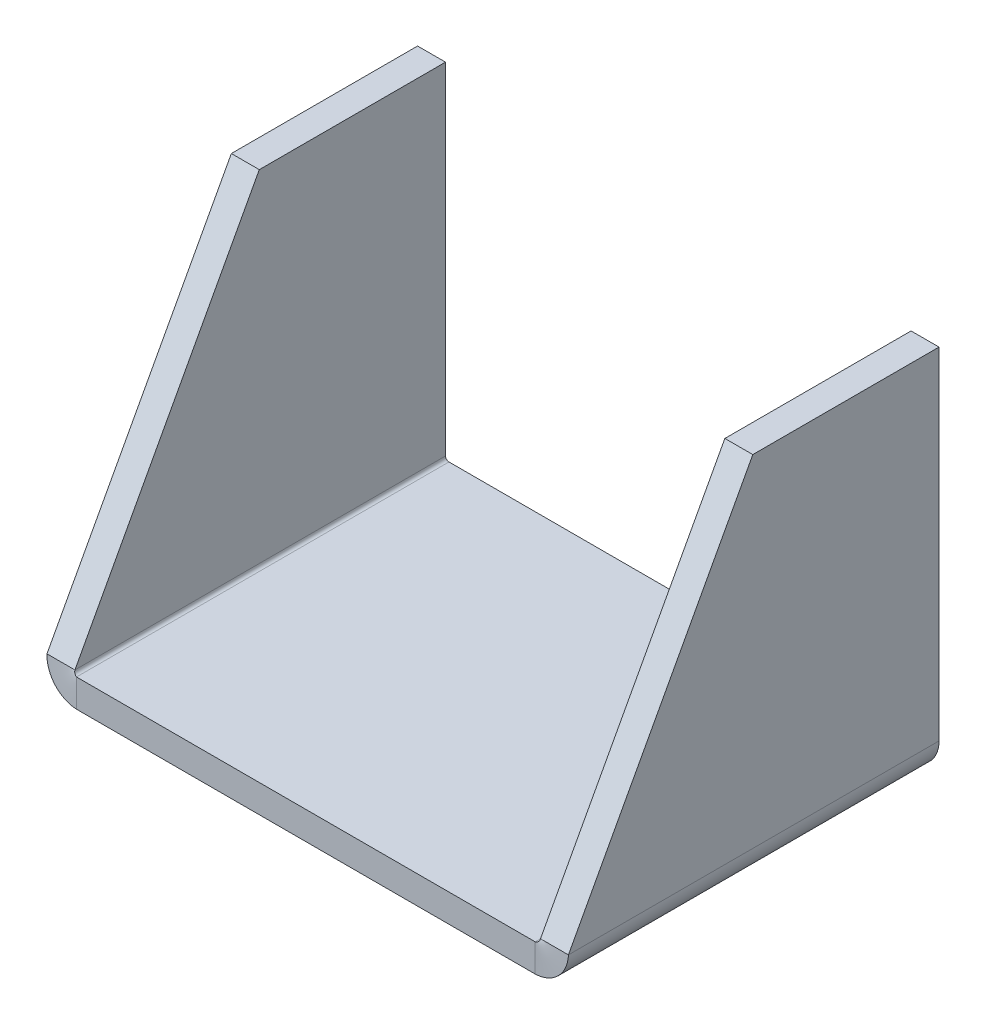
ISO-10303-21;
HEADER;
FILE_DESCRIPTION(('STEP AP214'),'2;1');
FILE_NAME('part.step','',(''),(''),'','','');
FILE_SCHEMA(('AUTOMOTIVE_DESIGN { 1 0 10303 214 1 1 1 1 }'));
ENDSEC;
DATA;
#1=APPLICATION_CONTEXT('core data for automotive mechanical design processes');
#2=APPLICATION_PROTOCOL_DEFINITION('international standard','automotive_design',2000,#1);
#3=PRODUCT_CONTEXT('',#1,'mechanical');
#4=PRODUCT('Part','Part','',(#3));
#5=PRODUCT_RELATED_PRODUCT_CATEGORY('part','',(#4));
#6=PRODUCT_DEFINITION_FORMATION('','',#4);
#7=PRODUCT_DEFINITION_CONTEXT('part definition',#1,'design');
#8=PRODUCT_DEFINITION('design','',#6,#7);
#9=PRODUCT_DEFINITION_SHAPE('','',#8);
#10=(LENGTH_UNIT() NAMED_UNIT(*) SI_UNIT(.MILLI.,.METRE.));
#11=(NAMED_UNIT(*) PLANE_ANGLE_UNIT() SI_UNIT($,.RADIAN.));
#12=(NAMED_UNIT(*) SI_UNIT($,.STERADIAN.) SOLID_ANGLE_UNIT());
#13=UNCERTAINTY_MEASURE_WITH_UNIT(LENGTH_MEASURE(1.E-05),#10,'distance_accuracy_value','');
#14=(GEOMETRIC_REPRESENTATION_CONTEXT(3) GLOBAL_UNCERTAINTY_ASSIGNED_CONTEXT((#13)) GLOBAL_UNIT_ASSIGNED_CONTEXT((#10,
#11,#12)) REPRESENTATION_CONTEXT('',''));
#15=CARTESIAN_POINT('',(0.,0.,0.));
#16=DIRECTION('',(0.,0.,1.));
#17=DIRECTION('',(1.,0.,0.));
#18=AXIS2_PLACEMENT_3D('',#15,#16,#17);
#19=CARTESIAN_POINT('',(-50.,-6.,80.));
#20=DIRECTION('',(0.,1.,0.));
#21=DIRECTION('',(0.,0.,1.));
#22=AXIS2_PLACEMENT_3D('',#19,#20,#21);
#23=PLANE('',#22);
#24=DIRECTION('',(0.,0.,-1.));
#25=VECTOR('',#24,1.);
#26=CARTESIAN_POINT('',(49.2634,-6.,0.));
#27=LINE('',#26,#25);
#28=CARTESIAN_POINT('',(49.2634,-6.,0.));
#29=VERTEX_POINT('',#28);
#30=CARTESIAN_POINT('',(49.2634,-6.,80.));
#31=VERTEX_POINT('',#30);
#32=EDGE_CURVE('E170',#29,#31,#27,.F.);
#33=ORIENTED_EDGE('',*,*,#32,.T.);
#34=DIRECTION('',(1.,0.,0.));
#35=VECTOR('',#34,1.);
#36=CARTESIAN_POINT('',(-50.,-6.,80.));
#37=LINE('',#36,#35);
#38=CARTESIAN_POINT('',(-49.2634,-6.,80.));
#39=VERTEX_POINT('',#38);
#40=EDGE_CURVE('E49',#39,#31,#37,.T.);
#41=ORIENTED_EDGE('',*,*,#40,.F.);
#42=DIRECTION('',(0.,0.,1.));
#43=VECTOR('',#42,1.);
#44=CARTESIAN_POINT('',(-49.2634,-6.,80.));
#45=LINE('',#44,#43);
#46=CARTESIAN_POINT('',(-49.2634,-6.,0.));
#47=VERTEX_POINT('',#46);
#48=EDGE_CURVE('E248',#39,#47,#45,.F.);
#49=ORIENTED_EDGE('',*,*,#48,.T.);
#50=DIRECTION('',(1.,0.,0.));
#51=VECTOR('',#50,1.);
#52=CARTESIAN_POINT('',(-50.,-6.,0.));
#53=LINE('',#52,#51);
#54=EDGE_CURVE('E263',#47,#29,#53,.T.);
#55=ORIENTED_EDGE('',*,*,#54,.T.);
#56=EDGE_LOOP('',(#33,#41,#49,#55));
#57=FACE_BOUND('',#56,.T.);
#58=ADVANCED_FACE('F41',(#57),#23,.F.);
#59=CARTESIAN_POINT('',(-50.,0.,80.));
#60=DIRECTION('',(0.,1.,0.));
#61=DIRECTION('',(0.,0.,1.));
#62=AXIS2_PLACEMENT_3D('',#59,#60,#61);
#63=PLANE('',#62);
#64=DIRECTION('',(1.,0.,0.));
#65=VECTOR('',#64,1.);
#66=CARTESIAN_POINT('',(-50.,0.,80.));
#67=LINE('',#66,#65);
#68=CARTESIAN_POINT('',(-49.2634,0.,80.));
#69=VERTEX_POINT('',#68);
#70=CARTESIAN_POINT('',(49.2634,0.,80.));
#71=VERTEX_POINT('',#70);
#72=EDGE_CURVE('E11',#69,#71,#67,.T.);
#73=ORIENTED_EDGE('',*,*,#72,.T.);
#74=DIRECTION('',(0.,0.,-1.));
#75=VECTOR('',#74,1.);
#76=CARTESIAN_POINT('',(49.2634,0.,0.));
#77=LINE('',#76,#75);
#78=CARTESIAN_POINT('',(49.2634,0.,0.));
#79=VERTEX_POINT('',#78);
#80=EDGE_CURVE('E174',#79,#71,#77,.F.);
#81=ORIENTED_EDGE('',*,*,#80,.F.);
#82=DIRECTION('',(1.,0.,0.));
#83=VECTOR('',#82,1.);
#84=CARTESIAN_POINT('',(-50.,0.,0.));
#85=LINE('',#84,#83);
#86=CARTESIAN_POINT('',(-49.2634,0.,0.));
#87=VERTEX_POINT('',#86);
#88=EDGE_CURVE('E44',#87,#79,#85,.T.);
#89=ORIENTED_EDGE('',*,*,#88,.F.);
#90=DIRECTION('',(0.,0.,1.));
#91=VECTOR('',#90,1.);
#92=CARTESIAN_POINT('',(-49.2634,0.,80.));
#93=LINE('',#92,#91);
#94=EDGE_CURVE('E56',#69,#87,#93,.F.);
#95=ORIENTED_EDGE('',*,*,#94,.F.);
#96=EDGE_LOOP('',(#73,#81,#89,#95));
#97=FACE_BOUND('',#96,.T.);
#98=ADVANCED_FACE('F365',(#97),#63,.T.);
#99=CARTESIAN_POINT('',(50.,-6.,80.));
#100=DIRECTION('',(0.,0.,-1.));
#101=DIRECTION('',(-1.,0.,0.));
#102=AXIS2_PLACEMENT_3D('',#99,#100,#101);
#103=PLANE('',#102);
#104=DIRECTION('',(0.,-1.,0.));
#105=VECTOR('',#104,1.);
#106=CARTESIAN_POINT('',(49.2634,0.,80.));
#107=LINE('',#106,#105);
#108=EDGE_CURVE('E276',#71,#31,#107,.T.);
#109=ORIENTED_EDGE('',*,*,#108,.F.);
#110=ORIENTED_EDGE('',*,*,#72,.F.);
#111=DIRECTION('',(0.,-1.,0.));
#112=VECTOR('',#111,1.);
#113=CARTESIAN_POINT('',(-49.2634,0.,80.));
#114=LINE('',#113,#112);
#115=EDGE_CURVE('E264',#69,#39,#114,.T.);
#116=ORIENTED_EDGE('',*,*,#115,.T.);
#117=ORIENTED_EDGE('',*,*,#40,.T.);
#118=EDGE_LOOP('',(#109,#110,#116,#117));
#119=FACE_BOUND('',#118,.T.);
#120=ADVANCED_FACE('F362',(#119),#103,.F.);
#121=CARTESIAN_POINT('',(50.,-6.,0.));
#122=DIRECTION('',(0.,0.,-1.));
#123=DIRECTION('',(-1.,0.,0.));
#124=AXIS2_PLACEMENT_3D('',#121,#122,#123);
#125=PLANE('',#124);
#126=ORIENTED_EDGE('',*,*,#88,.T.);
#127=DIRECTION('',(0.,-1.,0.));
#128=VECTOR('',#127,1.);
#129=CARTESIAN_POINT('',(49.2634,0.,0.));
#130=LINE('',#129,#128);
#131=EDGE_CURVE('E272',#79,#29,#130,.T.);
#132=ORIENTED_EDGE('',*,*,#131,.T.);
#133=ORIENTED_EDGE('',*,*,#54,.F.);
#134=DIRECTION('',(0.,-1.,0.));
#135=VECTOR('',#134,1.);
#136=CARTESIAN_POINT('',(-49.2634,0.,0.));
#137=LINE('',#136,#135);
#138=EDGE_CURVE('E64',#87,#47,#137,.T.);
#139=ORIENTED_EDGE('',*,*,#138,.F.);
#140=EDGE_LOOP('',(#126,#132,#133,#139));
#141=FACE_BOUND('',#140,.T.);
#142=ADVANCED_FACE('F271',(#141),#125,.T.);
#143=CARTESIAN_POINT('',(-49.2634,0.736600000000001,0.));
#144=DIRECTION('',(0.,0.,-1.));
#145=DIRECTION('',(0.,1.,0.));
#146=AXIS2_PLACEMENT_3D('',#143,#144,#145);
#147=PLANE('',#146);
#148=DIRECTION('',(-1.,0.,0.));
#149=VECTOR('',#148,1.);
#150=CARTESIAN_POINT('',(-50.,0.736599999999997,0.));
#151=LINE('',#150,#149);
#152=CARTESIAN_POINT('',(-50.,0.736599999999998,0.));
#153=VERTEX_POINT('',#152);
#154=CARTESIAN_POINT('',(-56.,0.736599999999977,0.));
#155=VERTEX_POINT('',#154);
#156=EDGE_CURVE('E304',#153,#155,#151,.T.);
#157=ORIENTED_EDGE('',*,*,#156,.F.);
#158=CARTESIAN_POINT('',(-49.2634,0.736600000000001,0.));
#159=DIRECTION('',(0.,0.,1.));
#160=DIRECTION('',(0.,-1.,0.));
#161=AXIS2_PLACEMENT_3D('',#158,#159,#160);
#162=CIRCLE('',#161,0.736599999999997);
#163=EDGE_CURVE('E249',#87,#153,#162,.F.);
#164=ORIENTED_EDGE('',*,*,#163,.F.);
#165=ORIENTED_EDGE('',*,*,#138,.T.);
#166=CARTESIAN_POINT('',(-49.2634,0.736600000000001,0.));
#167=DIRECTION('',(0.,0.,1.));
#168=DIRECTION('',(0.,-1.,0.));
#169=AXIS2_PLACEMENT_3D('',#166,#167,#168);
#170=CIRCLE('',#169,6.7366);
#171=EDGE_CURVE('E260',#47,#155,#170,.F.);
#172=ORIENTED_EDGE('',*,*,#171,.T.);
#173=EDGE_LOOP('',(#157,#164,#165,#172));
#174=FACE_BOUND('',#173,.T.);
#175=ADVANCED_FACE('F239',(#174),#147,.T.);
#176=CARTESIAN_POINT('',(-56.06,0.736599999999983,79.6018378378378));
#177=CARTESIAN_POINT('',(-56.06,-0.153233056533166,79.6350239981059));
#178=CARTESIAN_POINT('',(-55.8831026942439,-1.0423956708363,79.6681981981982));
#179=CARTESIAN_POINT('',(-55.2021765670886,-2.68629676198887,79.7345585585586));
#180=CARTESIAN_POINT('',(-54.6984156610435,-3.44022823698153,79.7677387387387));
#181=CARTESIAN_POINT('',(-53.4402282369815,-4.69841566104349,79.8340990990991));
#182=CARTESIAN_POINT('',(-52.6862967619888,-5.20217656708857,79.8672792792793));
#183=CARTESIAN_POINT('',(-51.0423956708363,-5.88310269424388,79.9336396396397));
#184=CARTESIAN_POINT('',(-50.1532330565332,-6.06,79.9668138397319));
#185=CARTESIAN_POINT('',(-49.2634,-6.06,80.));
#186=CARTESIAN_POINT('',(-56.,0.736599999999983,79.6018378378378));
#187=CARTESIAN_POINT('',(-56.,-0.14537764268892,79.6350239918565));
#188=CARTESIAN_POINT('',(-55.8246643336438,-1.02669079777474,79.6681981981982));
#189=CARTESIAN_POINT('',(-55.1497493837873,-2.65607962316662,79.7345585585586));
#190=CARTESIAN_POINT('',(-54.6504356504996,-3.40335543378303,79.7677387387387));
#191=CARTESIAN_POINT('',(-53.403355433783,-4.6504356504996,79.8340990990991));
#192=CARTESIAN_POINT('',(-52.6560796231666,-5.14974938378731,79.8672792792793));
#193=CARTESIAN_POINT('',(-51.0266907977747,-5.82466433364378,79.9336396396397));
#194=CARTESIAN_POINT('',(-50.145377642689,-6.,79.9668138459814));
#195=CARTESIAN_POINT('',(-49.2634,-6.,80.));
#196=CARTESIAN_POINT('',(-50.,0.736599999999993,79.6018378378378));
#197=CARTESIAN_POINT('',(-50.,0.640163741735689,79.6350233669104));
#198=CARTESIAN_POINT('',(-49.9808282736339,0.543796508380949,79.6681981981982));
#199=CARTESIAN_POINT('',(-49.9070310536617,0.365634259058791,79.7345585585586));
#200=CARTESIAN_POINT('',(-49.8524345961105,0.283924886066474,79.7677387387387));
#201=CARTESIAN_POINT('',(-49.7160751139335,0.147565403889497,79.8340990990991));
#202=CARTESIAN_POINT('',(-49.6343657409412,0.0929689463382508,79.8672792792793));
#203=CARTESIAN_POINT('',(-49.456203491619,0.0191717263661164,79.9336396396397));
#204=CARTESIAN_POINT('',(-49.3598362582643,0.,79.9668144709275));
#205=CARTESIAN_POINT('',(-49.2634,0.,80.));
#206=CARTESIAN_POINT('',(-49.9394,0.736599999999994,79.6018378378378));
#207=CARTESIAN_POINT('',(-49.9394,0.648097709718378,79.6350233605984));
#208=CARTESIAN_POINT('',(-49.9218055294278,0.559658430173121,79.6681981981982));
#209=CARTESIAN_POINT('',(-49.8540795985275,0.396153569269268,79.7345585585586));
#210=CARTESIAN_POINT('',(-49.8039747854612,0.321166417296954,79.7677387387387));
#211=CARTESIAN_POINT('',(-49.678833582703,0.196025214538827,79.8340990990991));
#212=CARTESIAN_POINT('',(-49.6038464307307,0.145920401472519,79.8672792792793));
#213=CARTESIAN_POINT('',(-49.4403415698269,0.0781944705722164,79.9336396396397));
#214=CARTESIAN_POINT('',(-49.3519022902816,0.0605999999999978,79.9668144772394));
#215=CARTESIAN_POINT('',(-49.2634,0.0605999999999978,80.));
#216=B_SPLINE_SURFACE_WITH_KNOTS('',1,3,((#176,#177,#178,#179,#180,#181,#182,#183,#184,#185),
(#186,#187,#188,#189,#190,#191,#192,#193,#194,#195),(#196,#197,#198,#199,#200,#201,#202,#203,
#204,#205),(#206,#207,#208,#209,#210,#211,#212,#213,#214,#215)),.UNSPECIFIED.,.F.,.F.,.F.,(2,1,
1,2),(4,2,2,2,4),(-0.01,0.,1.,1.0101),(0.,0.25,0.5,0.75,1.),.UNSPECIFIED.);
#217=CARTESIAN_POINT('',(-50.,0.736599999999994,79.6018378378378));
#218=CARTESIAN_POINT('',(-50.0000002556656,0.72454739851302,79.6059853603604));
#219=CARTESIAN_POINT('',(-49.9997041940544,0.712494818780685,79.6101328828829));
#220=CARTESIAN_POINT('',(-49.9985212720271,0.688418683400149,79.6184279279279));
#221=CARTESIAN_POINT('',(-49.997634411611,0.676395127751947,79.6225754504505));
#222=CARTESIAN_POINT('',(-49.9952717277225,0.652406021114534,79.6308704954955));
#223=CARTESIAN_POINT('',(-49.9937959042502,0.640440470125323,79.635018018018));
#224=CARTESIAN_POINT('',(-49.9902589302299,0.616596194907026,79.6433130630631));
#225=CARTESIAN_POINT('',(-49.988197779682,0.604717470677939,79.6474605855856));
#226=CARTESIAN_POINT('',(-49.983495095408,0.58107546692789,79.6557556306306));
#227=CARTESIAN_POINT('',(-49.980853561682,0.569312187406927,79.6599031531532));
#228=CARTESIAN_POINT('',(-49.9749964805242,0.545929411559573,79.6681981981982));
#229=CARTESIAN_POINT('',(-49.9717809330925,0.534309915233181,79.6723457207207));
#230=CARTESIAN_POINT('',(-49.9647835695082,0.511242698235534,79.6806407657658));
#231=CARTESIAN_POINT('',(-49.9610017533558,0.499794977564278,79.6847882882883));
#232=CARTESIAN_POINT('',(-49.9528809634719,0.477098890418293,79.6930833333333));
#233=CARTESIAN_POINT('',(-49.9485419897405,0.465850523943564,79.6972308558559));
#234=CARTESIAN_POINT('',(-49.9393173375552,0.443580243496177,79.7055259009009));
#235=CARTESIAN_POINT('',(-49.9344316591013,0.432558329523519,79.7096734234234));
#236=CARTESIAN_POINT('',(-49.9241253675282,0.410767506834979,79.7179684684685));
#237=CARTESIAN_POINT('',(-49.918704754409,0.399998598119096,79.722115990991));
#238=CARTESIAN_POINT('',(-49.907341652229,0.378739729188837,79.730411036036));
#239=CARTESIAN_POINT('',(-49.9013991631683,0.36824976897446,79.7345585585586));
#240=CARTESIAN_POINT('',(-49.8890066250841,0.347574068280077,79.7428536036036));
#241=CARTESIAN_POINT('',(-49.8825565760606,0.337388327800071,79.7470011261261));
#242=CARTESIAN_POINT('',(-49.8691644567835,0.317345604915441,79.7552961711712));
#243=CARTESIAN_POINT('',(-49.8622223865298,0.307488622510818,79.7594436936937));
#244=CARTESIAN_POINT('',(-49.8478629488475,0.288127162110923,79.7677387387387));
#245=CARTESIAN_POINT('',(-49.840445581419,0.278622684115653,79.7718862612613));
#246=CARTESIAN_POINT('',(-49.825153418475,0.259989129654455,79.7801813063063));
#247=CARTESIAN_POINT('',(-49.8172786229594,0.250860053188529,79.7843288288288));
#248=CARTESIAN_POINT('',(-49.8010905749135,0.232999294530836,79.7926238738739));
#249=CARTESIAN_POINT('',(-49.7927773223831,0.22426761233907,79.7967713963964));
#250=CARTESIAN_POINT('',(-49.7757323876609,0.207222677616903,79.8050664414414));
#251=CARTESIAN_POINT('',(-49.7670007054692,0.198909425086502,79.809213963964));
#252=CARTESIAN_POINT('',(-49.7491399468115,0.182721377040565,79.817509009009));
#253=CARTESIAN_POINT('',(-49.7400108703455,0.174846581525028,79.8216565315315));
#254=CARTESIAN_POINT('',(-49.7213773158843,0.15955441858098,79.8299515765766));
#255=CARTESIAN_POINT('',(-49.7118728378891,0.152137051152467,79.8340990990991));
#256=CARTESIAN_POINT('',(-49.6925113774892,0.137777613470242,79.8423941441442));
#257=CARTESIAN_POINT('',(-49.6826543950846,0.130835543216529,79.8465416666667));
#258=CARTESIAN_POINT('',(-49.6626116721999,0.117443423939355,79.8548367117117));
#259=CARTESIAN_POINT('',(-49.6524259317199,0.110993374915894,79.8589842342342));
#260=CARTESIAN_POINT('',(-49.6317502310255,0.0986008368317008,79.8672792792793));
#261=CARTESIAN_POINT('',(-49.6212602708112,0.092658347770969,79.8714268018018));
#262=CARTESIAN_POINT('',(-49.6000014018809,0.0812952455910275,79.8797218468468));
#263=CARTESIAN_POINT('',(-49.589232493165,0.0758746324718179,79.8838693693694));
#264=CARTESIAN_POINT('',(-49.5674416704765,0.0655683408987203,79.8921644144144));
#265=CARTESIAN_POINT('',(-49.5564197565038,0.0606826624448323,79.8963119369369));
#266=CARTESIAN_POINT('',(-49.5341494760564,0.0514580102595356,79.904606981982));
#267=CARTESIAN_POINT('',(-49.5229011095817,0.047119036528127,79.9087545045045));
#268=CARTESIAN_POINT('',(-49.5002050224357,0.0389982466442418,79.9170495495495));
#269=CARTESIAN_POINT('',(-49.4887573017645,0.0352164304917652,79.9211970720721));
#270=CARTESIAN_POINT('',(-49.4656900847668,0.0282190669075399,79.9294921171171));
#271=CARTESIAN_POINT('',(-49.4540705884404,0.0250035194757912,79.9336396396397));
#272=CARTESIAN_POINT('',(-49.4306878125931,0.0191464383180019,79.9419346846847));
#273=CARTESIAN_POINT('',(-49.4189245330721,0.0165049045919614,79.9460822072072));
#274=CARTESIAN_POINT('',(-49.3952825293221,0.0118022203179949,79.9543772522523));
#275=CARTESIAN_POINT('',(-49.383403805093,0.00974106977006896,79.9585247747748));
#276=CARTESIAN_POINT('',(-49.3595595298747,0.00620409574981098,79.9668198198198));
#277=CARTESIAN_POINT('',(-49.3475939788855,0.00472827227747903,79.9709673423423));
#278=CARTESIAN_POINT('',(-49.3236048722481,0.00236558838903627,79.9792623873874));
#279=CARTESIAN_POINT('',(-49.3115813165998,0.0014787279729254,79.9834099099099));
#280=CARTESIAN_POINT('',(-49.2875051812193,0.000295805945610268,79.991704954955));
#281=CARTESIAN_POINT('',(-49.275452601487,-2.55665594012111E-07,79.9958524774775));
#282=CARTESIAN_POINT('',(-49.2634,0.,80.));
#283=B_SPLINE_CURVE_WITH_KNOTS('',3,(#217,#218,#219,#220,#221,#222,#223,#224,#225,#226,#227,
#228,#229,#230,#231,#232,#233,#234,#235,#236,#237,#238,#239,#240,#241,#242,#243,#244,#245,#246,
#247,#248,#249,#250,#251,#252,#253,#254,#255,#256,#257,#258,#259,#260,#261,#262,#263,#264,#265,
#266,#267,#268,#269,#270,#271,#272,#273,#274,#275,#276,#277,#278,#279,#280,#281,#282),
.UNSPECIFIED.,.F.,.F.,(4,2,2,2,2,2,2,2,2,2,2,2,2,2,2,2,2,2,2,2,2,2,2,2,2,2,2,2,2,2,2,2,4),(0.,
0.0382353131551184,0.0764706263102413,0.114705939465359,0.152941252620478,0.191176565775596,
0.229411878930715,0.267647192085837,0.305882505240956,0.344117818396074,0.382353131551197,
0.420588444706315,0.458823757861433,0.497059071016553,0.535294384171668,0.573529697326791,
0.611765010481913,0.650000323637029,0.688235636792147,0.726470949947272,0.764706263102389,
0.802941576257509,0.841176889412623,0.879412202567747,0.91764751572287,0.955882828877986,
0.994118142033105,1.03235345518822,1.07058876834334,1.10882408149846,1.14705939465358,
1.1852947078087,1.22353002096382),.UNSPECIFIED.);
#284=CARTESIAN_POINT('',(-50.,0.736599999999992,79.6018378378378));
#285=VERTEX_POINT('',#284);
#286=EDGE_CURVE('E250',#285,#69,#283,.T.);
#287=DIRECTION('',(-1.,0.,0.));
#288=VECTOR('',#287,1.);
#289=CARTESIAN_POINT('',(-50.,0.736599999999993,79.6018378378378));
#290=LINE('',#289,#288);
#291=CARTESIAN_POINT('',(-56.,0.736599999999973,79.6018378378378));
#292=VERTEX_POINT('',#291);
#293=EDGE_CURVE('E307',#285,#292,#290,.T.);
#294=CARTESIAN_POINT('',(-56.,0.736599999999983,79.6018378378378));
#295=CARTESIAN_POINT('',(-56.0000023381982,0.626372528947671,79.6059853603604));
#296=CARTESIAN_POINT('',(-55.9972946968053,0.516145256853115,79.6101328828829));
#297=CARTESIAN_POINT('',(-55.9864762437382,0.295956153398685,79.6184279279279));
#298=CARTESIAN_POINT('',(-55.9783654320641,0.185994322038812,79.6225754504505));
#299=CARTESIAN_POINT('',(-55.9567574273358,-0.0333988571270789,79.6308704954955));
#300=CARTESIAN_POINT('',(-55.9432602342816,-0.142830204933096,79.635018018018));
#301=CARTESIAN_POINT('',(-55.9109127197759,-0.360898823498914,79.6433130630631));
#302=CARTESIAN_POINT('',(-55.8920623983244,-0.469536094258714,79.6474605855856));
#303=CARTESIAN_POINT('',(-55.8490538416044,-0.685754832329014,79.6557556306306));
#304=CARTESIAN_POINT('',(-55.8248956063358,-0.793336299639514,79.6599031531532));
#305=CARTESIAN_POINT('',(-55.771329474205,-1.00718426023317,79.6681981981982));
#306=CARTESIAN_POINT('',(-55.7419215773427,-1.11345075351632,79.6723457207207));
#307=CARTESIAN_POINT('',(-55.6779269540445,-1.32441276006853,79.6806407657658));
#308=CARTESIAN_POINT('',(-55.6433402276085,-1.42910827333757,79.6847882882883));
#309=CARTESIAN_POINT('',(-55.5690712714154,-1.63667609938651,79.6930833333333));
#310=CARTESIAN_POINT('',(-55.5293890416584,-1.7395484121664,79.6972308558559));
#311=CARTESIAN_POINT('',(-55.4450246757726,-1.94322200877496,79.7055259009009));
#312=CARTESIAN_POINT('',(-55.4003425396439,-2.04402329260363,79.7096734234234));
#313=CARTESIAN_POINT('',(-55.3060860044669,-2.24331199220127,79.7179684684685));
#314=CARTESIAN_POINT('',(-55.2565116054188,-2.34179940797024,79.722115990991));
#315=CARTESIAN_POINT('',(-55.1525899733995,-2.53622310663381,79.730411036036));
#316=CARTESIAN_POINT('',(-55.0982427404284,-2.63215938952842,79.7345585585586));
#317=CARTESIAN_POINT('',(-54.9849063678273,-2.82124970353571,79.7428536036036));
#318=CARTESIAN_POINT('',(-54.9259172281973,-2.9144037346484,79.7470011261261));
#319=CARTESIAN_POINT('',(-54.8034391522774,-3.09770512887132,79.7552961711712));
#320=CARTESIAN_POINT('',(-54.7399502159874,-3.18785249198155,79.7594436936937));
#321=CARTESIAN_POINT('',(-54.6086254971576,-3.36492337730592,79.7677387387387));
#322=CARTESIAN_POINT('',(-54.5407897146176,-3.45184689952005,79.7718862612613));
#323=CARTESIAN_POINT('',(-54.4009347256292,-3.62226069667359,79.7801813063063));
#324=CARTESIAN_POINT('',(-54.3289155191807,-3.705750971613,79.7843288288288));
#325=CARTESIAN_POINT('',(-54.1808671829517,-3.86909713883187,79.7926238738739));
#326=CARTESIAN_POINT('',(-54.1048380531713,-3.94895303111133,79.7967713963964));
#327=CARTESIAN_POINT('',(-53.9489530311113,-4.10483805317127,79.8050664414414));
#328=CARTESIAN_POINT('',(-53.8690971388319,-4.18086718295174,79.809213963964));
#329=CARTESIAN_POINT('',(-53.705750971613,-4.32891551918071,79.817509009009));
#330=CARTESIAN_POINT('',(-53.6222606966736,-4.4009347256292,79.8216565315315));
#331=CARTESIAN_POINT('',(-53.45184689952,-4.54078971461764,79.8299515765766));
#332=CARTESIAN_POINT('',(-53.3649233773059,-4.60862549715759,79.8340990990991));
#333=CARTESIAN_POINT('',(-53.1878524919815,-4.73995021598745,79.8423941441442));
#334=CARTESIAN_POINT('',(-53.0977051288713,-4.80343915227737,79.8465416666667));
#335=CARTESIAN_POINT('',(-52.9144037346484,-4.92591722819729,79.8548367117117));
#336=CARTESIAN_POINT('',(-52.8212497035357,-4.98490636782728,79.8589842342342));
#337=CARTESIAN_POINT('',(-52.6321593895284,-5.09824274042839,79.8672792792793));
#338=CARTESIAN_POINT('',(-52.5362231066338,-5.1525899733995,79.8714268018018));
#339=CARTESIAN_POINT('',(-52.3417994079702,-5.25651160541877,79.8797218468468));
#340=CARTESIAN_POINT('',(-52.2433119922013,-5.30608600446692,79.8838693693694));
#341=CARTESIAN_POINT('',(-52.0440232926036,-5.40034253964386,79.8921644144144));
#342=CARTESIAN_POINT('',(-51.9432220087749,-5.44502467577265,79.8963119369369));
#343=CARTESIAN_POINT('',(-51.7395484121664,-5.52938904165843,79.904606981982));
#344=CARTESIAN_POINT('',(-51.6366760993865,-5.56907127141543,79.9087545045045));
#345=CARTESIAN_POINT('',(-51.4291082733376,-5.64334022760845,79.9170495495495));
#346=CARTESIAN_POINT('',(-51.3244127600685,-5.67792695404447,79.9211970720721));
#347=CARTESIAN_POINT('',(-51.1134507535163,-5.74192157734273,79.9294921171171));
#348=CARTESIAN_POINT('',(-51.0071842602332,-5.77132947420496,79.9336396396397));
#349=CARTESIAN_POINT('',(-50.7933362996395,-5.82489560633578,79.9419346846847));
#350=CARTESIAN_POINT('',(-50.685754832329,-5.84905384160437,79.9460822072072));
#351=CARTESIAN_POINT('',(-50.4695360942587,-5.89206239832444,79.9543772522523));
#352=CARTESIAN_POINT('',(-50.3608988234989,-5.91091271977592,79.9585247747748));
#353=CARTESIAN_POINT('',(-50.1428302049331,-5.94326023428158,79.9668198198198));
#354=CARTESIAN_POINT('',(-50.0333988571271,-5.95675742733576,79.9709673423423));
#355=CARTESIAN_POINT('',(-49.8140056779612,-5.97836543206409,79.9792623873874));
#356=CARTESIAN_POINT('',(-49.7040438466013,-5.98647624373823,79.9834099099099));
#357=CARTESIAN_POINT('',(-49.4838547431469,-5.99729469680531,79.991704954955));
#358=CARTESIAN_POINT('',(-49.3736274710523,-6.00000233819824,79.9958524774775));
#359=CARTESIAN_POINT('',(-49.2634,-6.,80.));
#360=B_SPLINE_CURVE_WITH_KNOTS('',3,(#294,#295,#296,#297,#298,#299,#300,#301,#302,#303,#304,
#305,#306,#307,#308,#309,#310,#311,#312,#313,#314,#315,#316,#317,#318,#319,#320,#321,#322,#323,
#324,#325,#326,#327,#328,#329,#330,#331,#332,#333,#334,#335,#336,#337,#338,#339,#340,#341,#342,
#343,#344,#345,#346,#347,#348,#349,#350,#351,#352,#353,#354,#355,#356,#357,#358,#359),
.UNSPECIFIED.,.F.,.F.,(4,2,2,2,2,2,2,2,2,2,2,2,2,2,2,2,2,2,2,2,2,2,2,2,2,2,2,2,2,2,2,2,4),(0.,
0.33088290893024,0.661765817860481,0.992648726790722,1.32353163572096,1.6544145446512,
1.98529745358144,2.31618036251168,2.64706327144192,2.97794618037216,3.3088290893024,
3.63971199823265,3.97059490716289,4.30147781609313,4.63236072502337,4.96324363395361,
5.29412654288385,5.62500945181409,5.95589236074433,6.28677526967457,6.61765817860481,
6.94854108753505,7.27942399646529,7.61030690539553,7.94118981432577,8.27207272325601,
8.60295563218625,8.9338385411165,9.26472145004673,9.59560435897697,9.92648726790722,
10.2573701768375,10.5882530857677),.UNSPECIFIED.);
#361=EDGE_CURVE('E243',#292,#39,#360,.T.);
#362=ORIENTED_EDGE('',*,*,#286,.F.);
#363=ORIENTED_EDGE('',*,*,#293,.T.);
#364=ORIENTED_EDGE('',*,*,#361,.T.);
#365=ORIENTED_EDGE('',*,*,#115,.F.);
#366=EDGE_LOOP('',(#362,#363,#364,#365));
#367=FACE_BOUND('',#366,.T.);
#368=ADVANCED_FACE('F237',(#367),#216,.F.);
#369=CARTESIAN_POINT('',(-49.2634,0.736599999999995,80.));
#370=DIRECTION('',(0.,0.,1.));
#371=DIRECTION('',(-1.,0.,0.));
#372=AXIS2_PLACEMENT_3D('',#369,#370,#371);
#373=CYLINDRICAL_SURFACE('',#372,6.7366);
#374=ORIENTED_EDGE('',*,*,#48,.F.);
#375=ORIENTED_EDGE('',*,*,#361,.F.);
#376=DIRECTION('',(0.,0.,-1.));
#377=VECTOR('',#376,1.);
#378=CARTESIAN_POINT('',(-56.,0.736599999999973,80.));
#379=LINE('',#378,#377);
#380=EDGE_CURVE('E310',#292,#155,#379,.T.);
#381=ORIENTED_EDGE('',*,*,#380,.T.);
#382=ORIENTED_EDGE('',*,*,#171,.F.);
#383=EDGE_LOOP('',(#374,#375,#381,#382));
#384=FACE_BOUND('',#383,.T.);
#385=ADVANCED_FACE('F233',(#384),#373,.T.);
#386=CARTESIAN_POINT('',(-49.2634,0.736599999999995,80.));
#387=DIRECTION('',(0.,0.,1.));
#388=DIRECTION('',(-1.,0.,0.));
#389=AXIS2_PLACEMENT_3D('',#386,#387,#388);
#390=CYLINDRICAL_SURFACE('',#389,0.736599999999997);
#391=ORIENTED_EDGE('',*,*,#94,.T.);
#392=ORIENTED_EDGE('',*,*,#163,.T.);
#393=DIRECTION('',(0.,0.,1.));
#394=VECTOR('',#393,1.);
#395=CARTESIAN_POINT('',(-50.,0.736599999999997,0.));
#396=LINE('',#395,#394);
#397=EDGE_CURVE('E305',#153,#285,#396,.T.);
#398=ORIENTED_EDGE('',*,*,#397,.T.);
#399=ORIENTED_EDGE('',*,*,#286,.T.);
#400=EDGE_LOOP('',(#391,#392,#398,#399));
#401=FACE_BOUND('',#400,.T.);
#402=ADVANCED_FACE('F231',(#401),#390,.F.);
#403=CARTESIAN_POINT('',(-56.0000000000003,74.,40.));
#404=DIRECTION('',(0.,-0.475517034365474,-0.879706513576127));
#405=DIRECTION('',(0.,0.879706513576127,-0.475517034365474));
#406=AXIS2_PLACEMENT_3D('',#403,#404,#405);
#407=PLANE('',#406);
#408=ORIENTED_EDGE('',*,*,#293,.F.);
#409=DIRECTION('',(0.,0.879706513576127,-0.475517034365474));
#410=VECTOR('',#409,1.);
#411=CARTESIAN_POINT('',(-50.0000000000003,74.,40.));
#412=LINE('',#411,#410);
#413=CARTESIAN_POINT('',(-50.0000000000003,74.,40.));
#414=VERTEX_POINT('',#413);
#415=EDGE_CURVE('E314',#285,#414,#412,.T.);
#416=ORIENTED_EDGE('',*,*,#415,.T.);
#417=DIRECTION('',(1.,0.,0.));
#418=VECTOR('',#417,1.);
#419=CARTESIAN_POINT('',(-56.0000000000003,74.,40.));
#420=LINE('',#419,#418);
#421=CARTESIAN_POINT('',(-56.0000000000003,74.,40.));
#422=VERTEX_POINT('',#421);
#423=EDGE_CURVE('E331',#422,#414,#420,.T.);
#424=ORIENTED_EDGE('',*,*,#423,.F.);
#425=DIRECTION('',(0.,0.879706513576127,-0.475517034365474));
#426=VECTOR('',#425,1.);
#427=CARTESIAN_POINT('',(-56.0000000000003,74.,40.));
#428=LINE('',#427,#426);
#429=EDGE_CURVE('E315',#292,#422,#428,.T.);
#430=ORIENTED_EDGE('',*,*,#429,.F.);
#431=EDGE_LOOP('',(#408,#416,#424,#430));
#432=FACE_BOUND('',#431,.T.);
#433=ADVANCED_FACE('F224',(#432),#407,.F.);
#434=CARTESIAN_POINT('',(-56.,0.,0.));
#435=DIRECTION('',(0.,0.,1.));
#436=DIRECTION('',(1.,0.,0.));
#437=AXIS2_PLACEMENT_3D('',#434,#435,#436);
#438=PLANE('',#437);
#439=ORIENTED_EDGE('',*,*,#156,.T.);
#440=DIRECTION('',(0.,-1.,0.));
#441=VECTOR('',#440,1.);
#442=CARTESIAN_POINT('',(-56.,0.,0.));
#443=LINE('',#442,#441);
#444=CARTESIAN_POINT('',(-56.0000000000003,74.,0.));
#445=VERTEX_POINT('',#444);
#446=EDGE_CURVE('E320',#445,#155,#443,.T.);
#447=ORIENTED_EDGE('',*,*,#446,.F.);
#448=DIRECTION('',(1.,0.,0.));
#449=VECTOR('',#448,1.);
#450=CARTESIAN_POINT('',(-56.0000000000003,74.,0.));
#451=LINE('',#450,#449);
#452=CARTESIAN_POINT('',(-50.0000000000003,74.,0.));
#453=VERTEX_POINT('',#452);
#454=EDGE_CURVE('E323',#445,#453,#451,.T.);
#455=ORIENTED_EDGE('',*,*,#454,.T.);
#456=DIRECTION('',(0.,-1.,0.));
#457=VECTOR('',#456,1.);
#458=CARTESIAN_POINT('',(-50.,0.,0.));
#459=LINE('',#458,#457);
#460=EDGE_CURVE('E318',#453,#153,#459,.T.);
#461=ORIENTED_EDGE('',*,*,#460,.T.);
#462=EDGE_LOOP('',(#439,#447,#455,#461));
#463=FACE_BOUND('',#462,.T.);
#464=ADVANCED_FACE('F217',(#463),#438,.F.);
#465=CARTESIAN_POINT('',(-56.,0.,80.));
#466=DIRECTION('',(1.,0.,0.));
#467=DIRECTION('',(0.,1.,0.));
#468=AXIS2_PLACEMENT_3D('',#465,#466,#467);
#469=PLANE('',#468);
#470=ORIENTED_EDGE('',*,*,#380,.F.);
#471=ORIENTED_EDGE('',*,*,#429,.T.);
#472=DIRECTION('',(0.,0.,-1.));
#473=VECTOR('',#472,1.);
#474=CARTESIAN_POINT('',(-56.0000000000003,74.,0.));
#475=LINE('',#474,#473);
#476=EDGE_CURVE('E317',#422,#445,#475,.T.);
#477=ORIENTED_EDGE('',*,*,#476,.T.);
#478=ORIENTED_EDGE('',*,*,#446,.T.);
#479=EDGE_LOOP('',(#470,#471,#477,#478));
#480=FACE_BOUND('',#479,.T.);
#481=ADVANCED_FACE('F213',(#480),#469,.F.);
#482=CARTESIAN_POINT('',(-50.,0.,80.));
#483=DIRECTION('',(1.,0.,0.));
#484=DIRECTION('',(0.,1.,0.));
#485=AXIS2_PLACEMENT_3D('',#482,#483,#484);
#486=PLANE('',#485);
#487=ORIENTED_EDGE('',*,*,#415,.F.);
#488=ORIENTED_EDGE('',*,*,#397,.F.);
#489=ORIENTED_EDGE('',*,*,#460,.F.);
#490=DIRECTION('',(0.,0.,-1.));
#491=VECTOR('',#490,1.);
#492=CARTESIAN_POINT('',(-50.0000000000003,74.,0.));
#493=LINE('',#492,#491);
#494=EDGE_CURVE('E325',#414,#453,#493,.T.);
#495=ORIENTED_EDGE('',*,*,#494,.F.);
#496=EDGE_LOOP('',(#487,#488,#489,#495));
#497=FACE_BOUND('',#496,.T.);
#498=ADVANCED_FACE('F216',(#497),#486,.T.);
#499=CARTESIAN_POINT('',(-56.0000000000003,74.,0.));
#500=DIRECTION('',(0.,-1.,0.));
#501=DIRECTION('',(1.,0.,0.));
#502=AXIS2_PLACEMENT_3D('',#499,#500,#501);
#503=PLANE('',#502);
#504=ORIENTED_EDGE('',*,*,#494,.T.);
#505=ORIENTED_EDGE('',*,*,#454,.F.);
#506=ORIENTED_EDGE('',*,*,#476,.F.);
#507=ORIENTED_EDGE('',*,*,#423,.T.);
#508=EDGE_LOOP('',(#504,#505,#506,#507));
#509=FACE_BOUND('',#508,.T.);
#510=ADVANCED_FACE('F203',(#509),#503,.F.);
#511=CARTESIAN_POINT('',(49.2634,-6.06,80.));
#512=CARTESIAN_POINT('',(50.1532330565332,-6.06,79.9668138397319));
#513=CARTESIAN_POINT('',(51.0423956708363,-5.88310269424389,79.9336396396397));
#514=CARTESIAN_POINT('',(52.6862967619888,-5.20217656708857,79.8672792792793));
#515=CARTESIAN_POINT('',(53.4402282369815,-4.6984156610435,79.8340990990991));
#516=CARTESIAN_POINT('',(54.6984156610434,-3.44022823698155,79.7677387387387));
#517=CARTESIAN_POINT('',(55.2021765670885,-2.68629676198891,79.7345585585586));
#518=CARTESIAN_POINT('',(55.8831026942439,-1.04239567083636,79.6681981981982));
#519=CARTESIAN_POINT('',(56.06,-0.153233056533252,79.6350239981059));
#520=CARTESIAN_POINT('',(56.06,0.736599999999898,79.6018378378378));
#521=CARTESIAN_POINT('',(49.2634,-6.,80.));
#522=CARTESIAN_POINT('',(50.145377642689,-6.,79.9668138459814));
#523=CARTESIAN_POINT('',(51.0266907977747,-5.82466433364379,79.9336396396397));
#524=CARTESIAN_POINT('',(52.6560796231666,-5.14974938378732,79.8672792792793));
#525=CARTESIAN_POINT('',(53.403355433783,-4.65043565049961,79.8340990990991));
#526=CARTESIAN_POINT('',(54.6504356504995,-3.40335543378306,79.7677387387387));
#527=CARTESIAN_POINT('',(55.1497493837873,-2.65607962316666,79.7345585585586));
#528=CARTESIAN_POINT('',(55.8246643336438,-1.02669079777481,79.6681981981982));
#529=CARTESIAN_POINT('',(56.,-0.145377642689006,79.6350239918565));
#530=CARTESIAN_POINT('',(56.,0.736599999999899,79.6018378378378));
#531=CARTESIAN_POINT('',(49.2634,0.,80.));
#532=CARTESIAN_POINT('',(49.3598362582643,0.,79.9668144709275));
#533=CARTESIAN_POINT('',(49.456203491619,0.0191717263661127,79.9336396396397));
#534=CARTESIAN_POINT('',(49.6343657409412,0.092968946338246,79.8672792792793));
#535=CARTESIAN_POINT('',(49.7160751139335,0.147565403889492,79.8340990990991));
#536=CARTESIAN_POINT('',(49.8524345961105,0.283924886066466,79.7677387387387));
#537=CARTESIAN_POINT('',(49.9070310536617,0.365634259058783,79.7345585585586));
#538=CARTESIAN_POINT('',(49.9808282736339,0.543796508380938,79.6681981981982));
#539=CARTESIAN_POINT('',(50.,0.640163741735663,79.6350233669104));
#540=CARTESIAN_POINT('',(50.,0.736599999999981,79.6018378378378));
#541=CARTESIAN_POINT('',(49.2634,0.0605999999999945,80.));
#542=CARTESIAN_POINT('',(49.3519022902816,0.0605999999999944,79.9668144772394));
#543=CARTESIAN_POINT('',(49.4403415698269,0.0781944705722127,79.9336396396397));
#544=CARTESIAN_POINT('',(49.6038464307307,0.145920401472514,79.8672792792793));
#545=CARTESIAN_POINT('',(49.678833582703,0.196025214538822,79.8340990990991));
#546=CARTESIAN_POINT('',(49.8039747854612,0.321166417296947,79.7677387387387));
#547=CARTESIAN_POINT('',(49.8540795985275,0.39615356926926,79.7345585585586));
#548=CARTESIAN_POINT('',(49.9218055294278,0.559658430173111,79.6681981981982));
#549=CARTESIAN_POINT('',(49.9394,0.648097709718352,79.6350233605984));
#550=CARTESIAN_POINT('',(49.9394,0.736599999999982,79.6018378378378));
#551=B_SPLINE_SURFACE_WITH_KNOTS('',1,3,((#511,#512,#513,#514,#515,#516,#517,#518,#519,#520),
(#521,#522,#523,#524,#525,#526,#527,#528,#529,#530),(#531,#532,#533,#534,#535,#536,#537,#538,
#539,#540),(#541,#542,#543,#544,#545,#546,#547,#548,#549,#550)),.UNSPECIFIED.,.F.,.F.,.F.,(2,1,
1,2),(4,2,2,2,4),(-0.01,0.,1.,1.0101),(0.,0.25,0.5,0.75,1.),.UNSPECIFIED.);
#552=DIRECTION('',(1.,0.,0.));
#553=VECTOR('',#552,1.);
#554=CARTESIAN_POINT('',(50.,0.736599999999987,79.6018378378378));
#555=LINE('',#554,#553);
#556=CARTESIAN_POINT('',(50.,0.736599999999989,79.6018378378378));
#557=VERTEX_POINT('',#556);
#558=CARTESIAN_POINT('',(56.,0.736599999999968,79.6018378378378));
#559=VERTEX_POINT('',#558);
#560=EDGE_CURVE('E285',#557,#559,#555,.T.);
#561=CARTESIAN_POINT('',(49.2634,0.,80.));
#562=CARTESIAN_POINT('',(49.275452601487,-2.5566559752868E-07,79.9958524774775));
#563=CARTESIAN_POINT('',(49.2875051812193,0.000295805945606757,79.991704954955));
#564=CARTESIAN_POINT('',(49.3115813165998,0.00147872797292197,79.9834099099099));
#565=CARTESIAN_POINT('',(49.3236048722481,0.00236558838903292,79.9792623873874));
#566=CARTESIAN_POINT('',(49.3475939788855,0.00472827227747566,79.9709673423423));
#567=CARTESIAN_POINT('',(49.3595595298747,0.00620409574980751,79.9668198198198));
#568=CARTESIAN_POINT('',(49.383403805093,0.0097410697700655,79.9585247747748));
#569=CARTESIAN_POINT('',(49.3952825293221,0.0118022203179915,79.9543772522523));
#570=CARTESIAN_POINT('',(49.4189245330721,0.0165049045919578,79.9460822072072));
#571=CARTESIAN_POINT('',(49.4306878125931,0.019146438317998,79.9419346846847));
#572=CARTESIAN_POINT('',(49.4540705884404,0.0250035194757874,79.9336396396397));
#573=CARTESIAN_POINT('',(49.4656900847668,0.0282190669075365,79.9294921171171));
#574=CARTESIAN_POINT('',(49.4887573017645,0.0352164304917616,79.9211970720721));
#575=CARTESIAN_POINT('',(49.5002050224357,0.0389982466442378,79.9170495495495));
#576=CARTESIAN_POINT('',(49.5229011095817,0.0471190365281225,79.9087545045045));
#577=CARTESIAN_POINT('',(49.5341494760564,0.0514580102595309,79.904606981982));
#578=CARTESIAN_POINT('',(49.5564197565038,0.0606826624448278,79.8963119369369));
#579=CARTESIAN_POINT('',(49.5674416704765,0.0655683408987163,79.8921644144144));
#580=CARTESIAN_POINT('',(49.589232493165,0.0758746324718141,79.8838693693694));
#581=CARTESIAN_POINT('',(49.6000014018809,0.0812952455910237,79.8797218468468));
#582=CARTESIAN_POINT('',(49.6212602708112,0.0926583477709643,79.8714268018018));
#583=CARTESIAN_POINT('',(49.6317502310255,0.0986008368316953,79.8672792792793));
#584=CARTESIAN_POINT('',(49.6524259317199,0.110993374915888,79.8589842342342));
#585=CARTESIAN_POINT('',(49.6626116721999,0.11744342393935,79.8548367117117));
#586=CARTESIAN_POINT('',(49.6826543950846,0.130835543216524,79.8465416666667));
#587=CARTESIAN_POINT('',(49.6925113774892,0.137777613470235,79.8423941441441));
#588=CARTESIAN_POINT('',(49.7118728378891,0.15213705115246,79.8340990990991));
#589=CARTESIAN_POINT('',(49.7213773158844,0.159554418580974,79.8299515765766));
#590=CARTESIAN_POINT('',(49.7400108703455,0.174846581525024,79.8216565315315));
#591=CARTESIAN_POINT('',(49.7491399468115,0.18272137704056,79.817509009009));
#592=CARTESIAN_POINT('',(49.7670007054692,0.198909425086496,79.809213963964));
#593=CARTESIAN_POINT('',(49.7757323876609,0.207222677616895,79.8050664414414));
#594=CARTESIAN_POINT('',(49.7927773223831,0.224267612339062,79.7967713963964));
#595=CARTESIAN_POINT('',(49.8010905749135,0.23299929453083,79.7926238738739));
#596=CARTESIAN_POINT('',(49.8172786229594,0.250860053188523,79.7843288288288));
#597=CARTESIAN_POINT('',(49.825153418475,0.259989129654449,79.7801813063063));
#598=CARTESIAN_POINT('',(49.840445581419,0.278622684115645,79.7718862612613));
#599=CARTESIAN_POINT('',(49.8478629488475,0.288127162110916,79.7677387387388));
#600=CARTESIAN_POINT('',(49.8622223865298,0.30748862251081,79.7594436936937));
#601=CARTESIAN_POINT('',(49.8691644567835,0.317345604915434,79.7552961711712));
#602=CARTESIAN_POINT('',(49.8825565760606,0.337388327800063,79.7470011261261));
#603=CARTESIAN_POINT('',(49.8890066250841,0.347574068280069,79.7428536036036));
#604=CARTESIAN_POINT('',(49.9013991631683,0.368249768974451,79.7345585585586));
#605=CARTESIAN_POINT('',(49.907341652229,0.378739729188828,79.730411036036));
#606=CARTESIAN_POINT('',(49.918704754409,0.399998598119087,79.722115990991));
#607=CARTESIAN_POINT('',(49.9241253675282,0.41076750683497,79.7179684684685));
#608=CARTESIAN_POINT('',(49.9344316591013,0.43255832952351,79.7096734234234));
#609=CARTESIAN_POINT('',(49.9393173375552,0.443580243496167,79.7055259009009));
#610=CARTESIAN_POINT('',(49.9485419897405,0.465850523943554,79.6972308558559));
#611=CARTESIAN_POINT('',(49.9528809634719,0.477098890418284,79.6930833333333));
#612=CARTESIAN_POINT('',(49.9610017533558,0.499794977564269,79.6847882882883));
#613=CARTESIAN_POINT('',(49.9647835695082,0.511242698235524,79.6806407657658));
#614=CARTESIAN_POINT('',(49.9717809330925,0.53430991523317,79.6723457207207));
#615=CARTESIAN_POINT('',(49.9749964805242,0.545929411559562,79.6681981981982));
#616=CARTESIAN_POINT('',(49.980853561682,0.569312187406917,79.6599031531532));
#617=CARTESIAN_POINT('',(49.983495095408,0.58107546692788,79.6557556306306));
#618=CARTESIAN_POINT('',(49.988197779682,0.604717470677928,79.6474605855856));
#619=CARTESIAN_POINT('',(49.9902589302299,0.616596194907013,79.6433130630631));
#620=CARTESIAN_POINT('',(49.9937959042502,0.640440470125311,79.635018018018));
#621=CARTESIAN_POINT('',(49.9952717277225,0.652406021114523,79.6308704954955));
#622=CARTESIAN_POINT('',(49.997634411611,0.676395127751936,79.6225754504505));
#623=CARTESIAN_POINT('',(49.9985212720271,0.688418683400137,79.6184279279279));
#624=CARTESIAN_POINT('',(49.9997041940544,0.712494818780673,79.6101328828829));
#625=CARTESIAN_POINT('',(50.0000002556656,0.724547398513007,79.6059853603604));
#626=CARTESIAN_POINT('',(50.,0.736599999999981,79.6018378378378));
#627=B_SPLINE_CURVE_WITH_KNOTS('',3,(#561,#562,#563,#564,#565,#566,#567,#568,#569,#570,#571,
#572,#573,#574,#575,#576,#577,#578,#579,#580,#581,#582,#583,#584,#585,#586,#587,#588,#589,#590,
#591,#592,#593,#594,#595,#596,#597,#598,#599,#600,#601,#602,#603,#604,#605,#606,#607,#608,#609,
#610,#611,#612,#613,#614,#615,#616,#617,#618,#619,#620,#621,#622,#623,#624,#625,#626),
.UNSPECIFIED.,.F.,.F.,(4,2,2,2,2,2,2,2,2,2,2,2,2,2,2,2,2,2,2,2,2,2,2,2,2,2,2,2,2,2,2,2,4),(0.,
0.0382353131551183,0.0764706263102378,0.114705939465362,0.15294125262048,0.191176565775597,
0.229411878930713,0.267647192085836,0.305882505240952,0.344117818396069,0.382353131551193,
0.420588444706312,0.458823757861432,0.497059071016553,0.535294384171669,0.573529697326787,
0.611765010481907,0.650000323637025,0.688235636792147,0.726470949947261,0.764706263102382,
0.802941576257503,0.841176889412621,0.879412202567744,0.917647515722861,0.955882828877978,
0.994118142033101,1.03235345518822,1.07058876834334,1.10882408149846,1.14705939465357,
1.1852947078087,1.22353002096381),.UNSPECIFIED.);
#628=EDGE_CURVE('E171',#71,#557,#627,.T.);
#629=CARTESIAN_POINT('',(49.2634,-6.00000000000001,80.));
#630=CARTESIAN_POINT('',(49.3736274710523,-6.00000233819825,79.9958524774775));
#631=CARTESIAN_POINT('',(49.4838547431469,-5.99729469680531,79.991704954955));
#632=CARTESIAN_POINT('',(49.7040438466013,-5.98647624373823,79.9834099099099));
#633=CARTESIAN_POINT('',(49.8140056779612,-5.97836543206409,79.9792623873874));
#634=CARTESIAN_POINT('',(50.0333988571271,-5.95675742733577,79.9709673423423));
#635=CARTESIAN_POINT('',(50.1428302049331,-5.94326023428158,79.9668198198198));
#636=CARTESIAN_POINT('',(50.3608988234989,-5.91091271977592,79.9585247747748));
#637=CARTESIAN_POINT('',(50.4695360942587,-5.89206239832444,79.9543772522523));
#638=CARTESIAN_POINT('',(50.685754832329,-5.84905384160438,79.9460822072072));
#639=CARTESIAN_POINT('',(50.7933362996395,-5.82489560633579,79.9419346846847));
#640=CARTESIAN_POINT('',(51.0071842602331,-5.77132947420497,79.9336396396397));
#641=CARTESIAN_POINT('',(51.1134507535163,-5.74192157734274,79.9294921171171));
#642=CARTESIAN_POINT('',(51.3244127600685,-5.67792695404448,79.9211970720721));
#643=CARTESIAN_POINT('',(51.4291082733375,-5.64334022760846,79.9170495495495));
#644=CARTESIAN_POINT('',(51.6366760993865,-5.56907127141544,79.9087545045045));
#645=CARTESIAN_POINT('',(51.7395484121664,-5.52938904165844,79.904606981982));
#646=CARTESIAN_POINT('',(51.9432220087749,-5.44502467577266,79.8963119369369));
#647=CARTESIAN_POINT('',(52.0440232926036,-5.40034253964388,79.8921644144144));
#648=CARTESIAN_POINT('',(52.2433119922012,-5.30608600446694,79.8838693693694));
#649=CARTESIAN_POINT('',(52.3417994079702,-5.25651160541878,79.8797218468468));
#650=CARTESIAN_POINT('',(52.5362231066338,-5.15258997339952,79.8714268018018));
#651=CARTESIAN_POINT('',(52.6321593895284,-5.09824274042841,79.8672792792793));
#652=CARTESIAN_POINT('',(52.8212497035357,-4.98490636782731,79.8589842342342));
#653=CARTESIAN_POINT('',(52.9144037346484,-4.92591722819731,79.8548367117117));
#654=CARTESIAN_POINT('',(53.0977051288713,-4.8034391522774,79.8465416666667));
#655=CARTESIAN_POINT('',(53.1878524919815,-4.73995021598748,79.8423941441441));
#656=CARTESIAN_POINT('',(53.3649233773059,-4.60862549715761,79.8340990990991));
#657=CARTESIAN_POINT('',(53.45184689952,-4.54078971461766,79.8299515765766));
#658=CARTESIAN_POINT('',(53.6222606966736,-4.40093472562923,79.8216565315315));
#659=CARTESIAN_POINT('',(53.705750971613,-4.32891551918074,79.817509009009));
#660=CARTESIAN_POINT('',(53.8690971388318,-4.18086718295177,79.809213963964));
#661=CARTESIAN_POINT('',(53.9489530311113,-4.1048380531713,79.8050664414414));
#662=CARTESIAN_POINT('',(54.1048380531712,-3.94895303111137,79.7967713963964));
#663=CARTESIAN_POINT('',(54.1808671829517,-3.8690971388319,79.7926238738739));
#664=CARTESIAN_POINT('',(54.3289155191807,-3.70575097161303,79.7843288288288));
#665=CARTESIAN_POINT('',(54.4009347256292,-3.62226069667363,79.7801813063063));
#666=CARTESIAN_POINT('',(54.5407897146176,-3.45184689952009,79.7718862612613));
#667=CARTESIAN_POINT('',(54.6086254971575,-3.36492337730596,79.7677387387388));
#668=CARTESIAN_POINT('',(54.7399502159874,-3.18785249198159,79.7594436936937));
#669=CARTESIAN_POINT('',(54.8034391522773,-3.09770512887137,79.7552961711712));
#670=CARTESIAN_POINT('',(54.9259172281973,-2.91440373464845,79.7470011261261));
#671=CARTESIAN_POINT('',(54.9849063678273,-2.82124970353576,79.7428536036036));
#672=CARTESIAN_POINT('',(55.0982427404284,-2.63215938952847,79.7345585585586));
#673=CARTESIAN_POINT('',(55.1525899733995,-2.53622310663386,79.730411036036));
#674=CARTESIAN_POINT('',(55.2565116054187,-2.34179940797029,79.722115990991));
#675=CARTESIAN_POINT('',(55.3060860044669,-2.24331199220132,79.7179684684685));
#676=CARTESIAN_POINT('',(55.4003425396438,-2.04402329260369,79.7096734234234));
#677=CARTESIAN_POINT('',(55.4450246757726,-1.94322200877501,79.7055259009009));
#678=CARTESIAN_POINT('',(55.5293890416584,-1.73954841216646,79.6972308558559));
#679=CARTESIAN_POINT('',(55.5690712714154,-1.63667609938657,79.6930833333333));
#680=CARTESIAN_POINT('',(55.6433402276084,-1.42910827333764,79.6847882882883));
#681=CARTESIAN_POINT('',(55.6779269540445,-1.32441276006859,79.6806407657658));
#682=CARTESIAN_POINT('',(55.7419215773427,-1.11345075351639,79.6723457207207));
#683=CARTESIAN_POINT('',(55.7713294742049,-1.00718426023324,79.6681981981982));
#684=CARTESIAN_POINT('',(55.8248956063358,-0.793336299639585,79.6599031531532));
#685=CARTESIAN_POINT('',(55.8490538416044,-0.685754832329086,79.6557556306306));
#686=CARTESIAN_POINT('',(55.8920623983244,-0.469536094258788,79.6474605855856));
#687=CARTESIAN_POINT('',(55.9109127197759,-0.360898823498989,79.6433130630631));
#688=CARTESIAN_POINT('',(55.9432602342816,-0.142830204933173,79.635018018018));
#689=CARTESIAN_POINT('',(55.9567574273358,-0.0333988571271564,79.6308704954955));
#690=CARTESIAN_POINT('',(55.9783654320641,0.185994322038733,79.6225754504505));
#691=CARTESIAN_POINT('',(55.9864762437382,0.295956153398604,79.6184279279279));
#692=CARTESIAN_POINT('',(55.9972946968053,0.516145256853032,79.6101328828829));
#693=CARTESIAN_POINT('',(56.0000023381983,0.626372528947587,79.6059853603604));
#694=CARTESIAN_POINT('',(56.,0.736599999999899,79.6018378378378));
#695=B_SPLINE_CURVE_WITH_KNOTS('',3,(#629,#630,#631,#632,#633,#634,#635,#636,#637,#638,#639,
#640,#641,#642,#643,#644,#645,#646,#647,#648,#649,#650,#651,#652,#653,#654,#655,#656,#657,#658,
#659,#660,#661,#662,#663,#664,#665,#666,#667,#668,#669,#670,#671,#672,#673,#674,#675,#676,#677,
#678,#679,#680,#681,#682,#683,#684,#685,#686,#687,#688,#689,#690,#691,#692,#693,#694),
.UNSPECIFIED.,.F.,.F.,(4,2,2,2,2,2,2,2,2,2,2,2,2,2,2,2,2,2,2,2,2,2,2,2,2,2,2,2,2,2,2,2,4),(0.,
0.33088290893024,0.661765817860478,0.992648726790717,1.32353163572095,1.65441454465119,
1.98529745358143,2.31618036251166,2.6470632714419,2.97794618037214,3.30882908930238,
3.63971199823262,3.97059490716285,4.30147781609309,4.63236072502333,4.96324363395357,
5.29412654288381,5.62500945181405,5.95589236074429,6.28677526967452,6.61765817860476,
6.948541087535,7.27942399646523,7.61030690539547,7.94118981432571,8.27207272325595,
8.60295563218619,8.93383854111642,9.26472145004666,9.5956043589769,9.92648726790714,
10.2573701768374,10.5882530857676),.UNSPECIFIED.);
#696=EDGE_CURVE('E277',#31,#559,#695,.T.);
#697=ORIENTED_EDGE('',*,*,#560,.F.);
#698=ORIENTED_EDGE('',*,*,#628,.F.);
#699=ORIENTED_EDGE('',*,*,#108,.T.);
#700=ORIENTED_EDGE('',*,*,#696,.T.);
#701=EDGE_LOOP('',(#697,#698,#699,#700));
#702=FACE_BOUND('',#701,.T.);
#703=ADVANCED_FACE('F198',(#702),#551,.F.);
#704=CARTESIAN_POINT('',(49.2634,0.736599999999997,0.));
#705=DIRECTION('',(0.,0.,1.));
#706=DIRECTION('',(0.,-1.,0.));
#707=AXIS2_PLACEMENT_3D('',#704,#705,#706);
#708=PLANE('',#707);
#709=CARTESIAN_POINT('',(49.2634,0.736599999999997,0.));
#710=DIRECTION('',(0.,0.,-1.));
#711=DIRECTION('',(0.,1.,0.));
#712=AXIS2_PLACEMENT_3D('',#709,#710,#711);
#713=CIRCLE('',#712,0.736599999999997);
#714=CARTESIAN_POINT('',(50.,0.736599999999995,0.));
#715=VERTEX_POINT('',#714);
#716=EDGE_CURVE('E151',#715,#79,#713,.T.);
#717=ORIENTED_EDGE('',*,*,#716,.F.);
#718=DIRECTION('',(1.,0.,0.));
#719=VECTOR('',#718,1.);
#720=CARTESIAN_POINT('',(50.,0.736599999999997,0.));
#721=LINE('',#720,#719);
#722=CARTESIAN_POINT('',(56.,0.736599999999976,0.));
#723=VERTEX_POINT('',#722);
#724=EDGE_CURVE('E284',#715,#723,#721,.T.);
#725=ORIENTED_EDGE('',*,*,#724,.T.);
#726=CARTESIAN_POINT('',(49.2634,0.736599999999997,0.));
#727=DIRECTION('',(0.,0.,-1.));
#728=DIRECTION('',(0.,1.,0.));
#729=AXIS2_PLACEMENT_3D('',#726,#727,#728);
#730=CIRCLE('',#729,6.7366);
#731=EDGE_CURVE('E167',#723,#29,#730,.T.);
#732=ORIENTED_EDGE('',*,*,#731,.T.);
#733=ORIENTED_EDGE('',*,*,#131,.F.);
#734=EDGE_LOOP('',(#717,#725,#732,#733));
#735=FACE_BOUND('',#734,.T.);
#736=ADVANCED_FACE('F195',(#735),#708,.F.);
#737=CARTESIAN_POINT('',(49.2634,0.736599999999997,0.));
#738=DIRECTION('',(0.,0.,-1.));
#739=DIRECTION('',(1.,0.,0.));
#740=AXIS2_PLACEMENT_3D('',#737,#738,#739);
#741=CYLINDRICAL_SURFACE('',#740,6.7366);
#742=ORIENTED_EDGE('',*,*,#32,.F.);
#743=ORIENTED_EDGE('',*,*,#731,.F.);
#744=DIRECTION('',(0.,0.,-1.));
#745=VECTOR('',#744,1.);
#746=CARTESIAN_POINT('',(56.,0.736599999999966,80.));
#747=LINE('',#746,#745);
#748=EDGE_CURVE('E139',#559,#723,#747,.T.);
#749=ORIENTED_EDGE('',*,*,#748,.F.);
#750=ORIENTED_EDGE('',*,*,#696,.F.);
#751=EDGE_LOOP('',(#742,#743,#749,#750));
#752=FACE_BOUND('',#751,.T.);
#753=ADVANCED_FACE('F193',(#752),#741,.T.);
#754=CARTESIAN_POINT('',(49.2634,0.736599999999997,0.));
#755=DIRECTION('',(0.,0.,-1.));
#756=DIRECTION('',(1.,0.,0.));
#757=AXIS2_PLACEMENT_3D('',#754,#755,#756);
#758=CYLINDRICAL_SURFACE('',#757,0.736599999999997);
#759=ORIENTED_EDGE('',*,*,#80,.T.);
#760=ORIENTED_EDGE('',*,*,#628,.T.);
#761=DIRECTION('',(0.,0.,-1.));
#762=VECTOR('',#761,1.);
#763=CARTESIAN_POINT('',(50.,0.736599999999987,79.6018378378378));
#764=LINE('',#763,#762);
#765=EDGE_CURVE('E281',#557,#715,#764,.T.);
#766=ORIENTED_EDGE('',*,*,#765,.T.);
#767=ORIENTED_EDGE('',*,*,#716,.T.);
#768=EDGE_LOOP('',(#759,#760,#766,#767));
#769=FACE_BOUND('',#768,.T.);
#770=ADVANCED_FACE('F182',(#769),#758,.F.);
#771=CARTESIAN_POINT('',(56.0000000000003,73.9999999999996,40.));
#772=DIRECTION('',(0.,-0.475517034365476,-0.879706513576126));
#773=DIRECTION('',(0.,0.879706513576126,-0.475517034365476));
#774=AXIS2_PLACEMENT_3D('',#771,#772,#773);
#775=PLANE('',#774);
#776=ORIENTED_EDGE('',*,*,#560,.T.);
#777=DIRECTION('',(0.,-0.879706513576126,0.475517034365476));
#778=VECTOR('',#777,1.);
#779=CARTESIAN_POINT('',(56.0000000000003,73.9999999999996,40.));
#780=LINE('',#779,#778);
#781=CARTESIAN_POINT('',(56.0000000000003,73.9999999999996,40.));
#782=VERTEX_POINT('',#781);
#783=EDGE_CURVE('E142',#782,#559,#780,.T.);
#784=ORIENTED_EDGE('',*,*,#783,.F.);
#785=DIRECTION('',(-1.,0.,0.));
#786=VECTOR('',#785,1.);
#787=CARTESIAN_POINT('',(56.0000000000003,73.9999999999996,40.));
#788=LINE('',#787,#786);
#789=CARTESIAN_POINT('',(50.0000000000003,73.9999999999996,40.));
#790=VERTEX_POINT('',#789);
#791=EDGE_CURVE('E152',#782,#790,#788,.T.);
#792=ORIENTED_EDGE('',*,*,#791,.T.);
#793=DIRECTION('',(0.,-0.879706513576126,0.475517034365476));
#794=VECTOR('',#793,1.);
#795=CARTESIAN_POINT('',(50.0000000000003,73.9999999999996,40.));
#796=LINE('',#795,#794);
#797=EDGE_CURVE('E161',#790,#557,#796,.T.);
#798=ORIENTED_EDGE('',*,*,#797,.T.);
#799=EDGE_LOOP('',(#776,#784,#792,#798));
#800=FACE_BOUND('',#799,.T.);
#801=ADVANCED_FACE('F192',(#800),#775,.F.);
#802=CARTESIAN_POINT('',(56.0000000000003,73.9999999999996,0.));
#803=DIRECTION('',(0.,0.,1.));
#804=DIRECTION('',(0.,-1.,0.));
#805=AXIS2_PLACEMENT_3D('',#802,#803,#804);
#806=PLANE('',#805);
#807=ORIENTED_EDGE('',*,*,#724,.F.);
#808=DIRECTION('',(0.,1.,0.));
#809=VECTOR('',#808,1.);
#810=CARTESIAN_POINT('',(50.0000000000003,73.9999999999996,0.));
#811=LINE('',#810,#809);
#812=CARTESIAN_POINT('',(50.0000000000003,73.9999999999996,0.));
#813=VERTEX_POINT('',#812);
#814=EDGE_CURVE('E148',#715,#813,#811,.T.);
#815=ORIENTED_EDGE('',*,*,#814,.T.);
#816=DIRECTION('',(-1.,0.,0.));
#817=VECTOR('',#816,1.);
#818=CARTESIAN_POINT('',(56.0000000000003,73.9999999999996,0.));
#819=LINE('',#818,#817);
#820=CARTESIAN_POINT('',(56.0000000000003,73.9999999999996,0.));
#821=VERTEX_POINT('',#820);
#822=EDGE_CURVE('E145',#821,#813,#819,.T.);
#823=ORIENTED_EDGE('',*,*,#822,.F.);
#824=DIRECTION('',(0.,1.,0.));
#825=VECTOR('',#824,1.);
#826=CARTESIAN_POINT('',(56.0000000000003,73.9999999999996,0.));
#827=LINE('',#826,#825);
#828=EDGE_CURVE('E132',#723,#821,#827,.T.);
#829=ORIENTED_EDGE('',*,*,#828,.F.);
#830=EDGE_LOOP('',(#807,#815,#823,#829));
#831=FACE_BOUND('',#830,.T.);
#832=ADVANCED_FACE('F146',(#831),#806,.F.);
#833=CARTESIAN_POINT('',(56.,0.,80.));
#834=DIRECTION('',(1.,0.,0.));
#835=DIRECTION('',(0.,1.,0.));
#836=AXIS2_PLACEMENT_3D('',#833,#834,#835);
#837=PLANE('',#836);
#838=ORIENTED_EDGE('',*,*,#783,.T.);
#839=ORIENTED_EDGE('',*,*,#748,.T.);
#840=ORIENTED_EDGE('',*,*,#828,.T.);
#841=DIRECTION('',(0.,0.,1.));
#842=VECTOR('',#841,1.);
#843=CARTESIAN_POINT('',(56.0000000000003,73.9999999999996,40.));
#844=LINE('',#843,#842);
#845=EDGE_CURVE('E137',#821,#782,#844,.T.);
#846=ORIENTED_EDGE('',*,*,#845,.T.);
#847=EDGE_LOOP('',(#838,#839,#840,#846));
#848=FACE_BOUND('',#847,.T.);
#849=ADVANCED_FACE('F135',(#848),#837,.T.);
#850=CARTESIAN_POINT('',(50.,0.,80.));
#851=DIRECTION('',(1.,0.,0.));
#852=DIRECTION('',(0.,1.,0.));
#853=AXIS2_PLACEMENT_3D('',#850,#851,#852);
#854=PLANE('',#853);
#855=ORIENTED_EDGE('',*,*,#765,.F.);
#856=ORIENTED_EDGE('',*,*,#797,.F.);
#857=DIRECTION('',(0.,0.,1.));
#858=VECTOR('',#857,1.);
#859=CARTESIAN_POINT('',(50.0000000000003,73.9999999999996,40.));
#860=LINE('',#859,#858);
#861=EDGE_CURVE('E165',#813,#790,#860,.T.);
#862=ORIENTED_EDGE('',*,*,#861,.F.);
#863=ORIENTED_EDGE('',*,*,#814,.F.);
#864=EDGE_LOOP('',(#855,#856,#862,#863));
#865=FACE_BOUND('',#864,.T.);
#866=ADVANCED_FACE('F485',(#865),#854,.F.);
#867=CARTESIAN_POINT('',(56.0000000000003,73.9999999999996,40.));
#868=DIRECTION('',(0.,-1.,0.));
#869=DIRECTION('',(1.,0.,0.));
#870=AXIS2_PLACEMENT_3D('',#867,#868,#869);
#871=PLANE('',#870);
#872=ORIENTED_EDGE('',*,*,#861,.T.);
#873=ORIENTED_EDGE('',*,*,#791,.F.);
#874=ORIENTED_EDGE('',*,*,#845,.F.);
#875=ORIENTED_EDGE('',*,*,#822,.T.);
#876=EDGE_LOOP('',(#872,#873,#874,#875));
#877=FACE_BOUND('',#876,.T.);
#878=ADVANCED_FACE('F154',(#877),#871,.F.);
#879=CLOSED_SHELL('',(#58,#98,#120,#142,#175,#368,#385,#402,#433,#464,#481,#498,#510,#703,#736,
#753,#770,#801,#832,#849,#866,#878));
#880=MANIFOLD_SOLID_BREP('B2',#879);
#881=ADVANCED_BREP_SHAPE_REPRESENTATION('',(#18,#880),#14);
#882=SHAPE_DEFINITION_REPRESENTATION(#9,#881);
ENDSEC;
END-ISO-10303-21;
